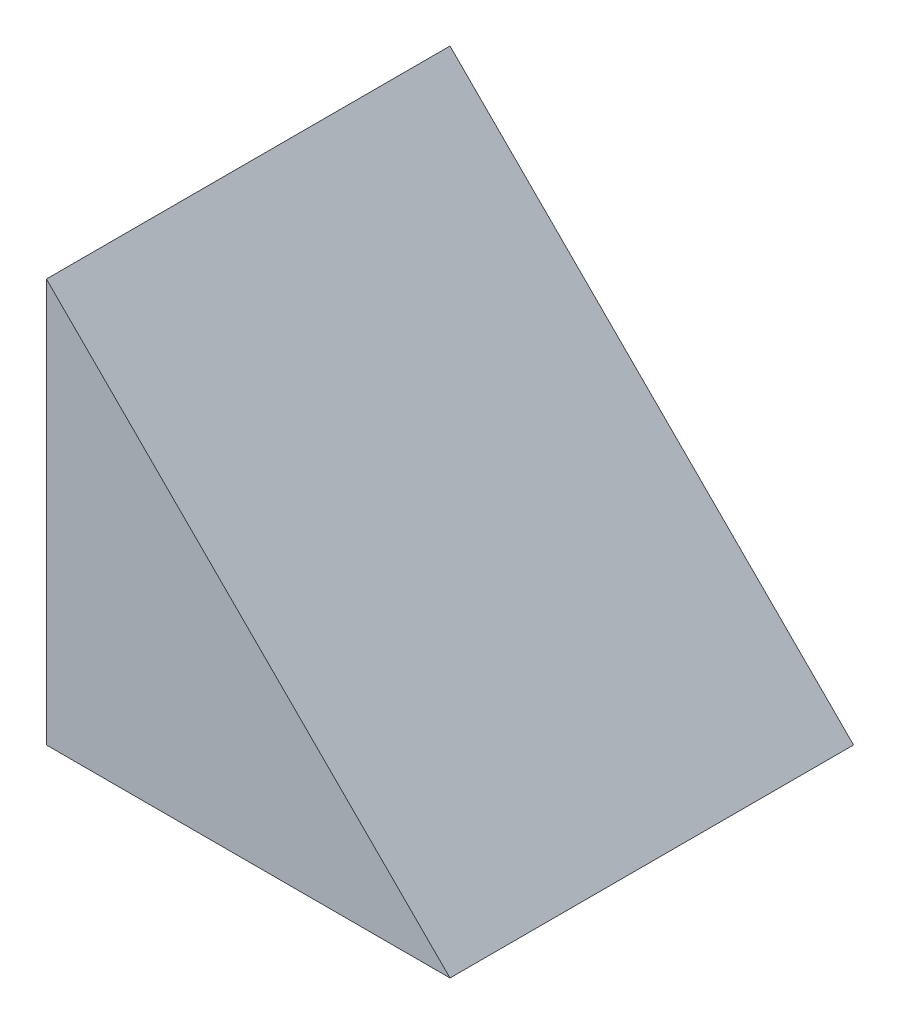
ISO-10303-21;
HEADER;
FILE_DESCRIPTION(('STEP AP214'),'2;1');
FILE_NAME('part.step','',(''),(''),'','','');
FILE_SCHEMA(('AUTOMOTIVE_DESIGN { 1 0 10303 214 1 1 1 1 }'));
ENDSEC;
DATA;
#1=APPLICATION_CONTEXT('core data for automotive mechanical design processes');
#2=APPLICATION_PROTOCOL_DEFINITION('international standard','automotive_design',2000,#1);
#3=PRODUCT_CONTEXT('',#1,'mechanical');
#4=PRODUCT('Part','Part','',(#3));
#5=PRODUCT_RELATED_PRODUCT_CATEGORY('part','',(#4));
#6=PRODUCT_DEFINITION_FORMATION('','',#4);
#7=PRODUCT_DEFINITION_CONTEXT('part definition',#1,'design');
#8=PRODUCT_DEFINITION('design','',#6,#7);
#9=PRODUCT_DEFINITION_SHAPE('','',#8);
#10=(LENGTH_UNIT() NAMED_UNIT(*) SI_UNIT(.MILLI.,.METRE.));
#11=(NAMED_UNIT(*) PLANE_ANGLE_UNIT() SI_UNIT($,.RADIAN.));
#12=(NAMED_UNIT(*) SI_UNIT($,.STERADIAN.) SOLID_ANGLE_UNIT());
#13=UNCERTAINTY_MEASURE_WITH_UNIT(LENGTH_MEASURE(1.E-05),#10,'distance_accuracy_value','');
#14=(GEOMETRIC_REPRESENTATION_CONTEXT(3) GLOBAL_UNCERTAINTY_ASSIGNED_CONTEXT((#13)) GLOBAL_UNIT_ASSIGNED_CONTEXT((#10,
#11,#12)) REPRESENTATION_CONTEXT('',''));
#15=CARTESIAN_POINT('',(0.,0.,0.));
#16=DIRECTION('',(0.,0.,1.));
#17=DIRECTION('',(1.,0.,0.));
#18=AXIS2_PLACEMENT_3D('',#15,#16,#17);
#19=CARTESIAN_POINT('',(0.,0.,15.));
#20=DIRECTION('',(-1.,0.,0.));
#21=DIRECTION('',(0.,-1.,0.));
#22=AXIS2_PLACEMENT_3D('',#19,#20,#21);
#23=PLANE('',#22);
#24=DIRECTION('',(0.,1.,0.));
#25=VECTOR('',#24,1.);
#26=CARTESIAN_POINT('',(0.,0.,0.));
#27=LINE('',#26,#25);
#28=CARTESIAN_POINT('',(0.,0.,0.));
#29=VERTEX_POINT('',#28);
#30=CARTESIAN_POINT('',(0.,15.,0.));
#31=VERTEX_POINT('',#30);
#32=EDGE_CURVE('E69',#29,#31,#27,.T.);
#33=ORIENTED_EDGE('',*,*,#32,.F.);
#34=DIRECTION('',(0.,0.,-1.));
#35=VECTOR('',#34,1.);
#36=CARTESIAN_POINT('',(0.,0.,15.));
#37=LINE('',#36,#35);
#38=CARTESIAN_POINT('',(0.,0.,15.));
#39=VERTEX_POINT('',#38);
#40=EDGE_CURVE('E11',#39,#29,#37,.T.);
#41=ORIENTED_EDGE('',*,*,#40,.F.);
#42=DIRECTION('',(0.,1.,0.));
#43=VECTOR('',#42,1.);
#44=CARTESIAN_POINT('',(0.,0.,15.));
#45=LINE('',#44,#43);
#46=CARTESIAN_POINT('',(0.,15.,15.));
#47=VERTEX_POINT('',#46);
#48=EDGE_CURVE('E67',#39,#47,#45,.T.);
#49=ORIENTED_EDGE('',*,*,#48,.T.);
#50=DIRECTION('',(0.,0.,-1.));
#51=VECTOR('',#50,1.);
#52=CARTESIAN_POINT('',(0.,15.,15.));
#53=LINE('',#52,#51);
#54=EDGE_CURVE('E49',#47,#31,#53,.T.);
#55=ORIENTED_EDGE('',*,*,#54,.T.);
#56=EDGE_LOOP('',(#33,#41,#49,#55));
#57=FACE_BOUND('',#56,.T.);
#58=ADVANCED_FACE('F33',(#57),#23,.T.);
#59=CARTESIAN_POINT('',(0.,0.,15.));
#60=DIRECTION('',(0.,1.,0.));
#61=DIRECTION('',(0.,0.,1.));
#62=AXIS2_PLACEMENT_3D('',#59,#60,#61);
#63=PLANE('',#62);
#64=DIRECTION('',(1.,0.,0.));
#65=VECTOR('',#64,1.);
#66=CARTESIAN_POINT('',(0.,0.,0.));
#67=LINE('',#66,#65);
#68=CARTESIAN_POINT('',(15.,0.,0.));
#69=VERTEX_POINT('',#68);
#70=EDGE_CURVE('E81',#29,#69,#67,.T.);
#71=ORIENTED_EDGE('',*,*,#70,.T.);
#72=DIRECTION('',(0.,0.,-1.));
#73=VECTOR('',#72,1.);
#74=CARTESIAN_POINT('',(15.,0.,15.));
#75=LINE('',#74,#73);
#76=CARTESIAN_POINT('',(15.,0.,15.));
#77=VERTEX_POINT('',#76);
#78=EDGE_CURVE('E41',#77,#69,#75,.T.);
#79=ORIENTED_EDGE('',*,*,#78,.F.);
#80=DIRECTION('',(1.,0.,0.));
#81=VECTOR('',#80,1.);
#82=CARTESIAN_POINT('',(0.,0.,15.));
#83=LINE('',#82,#81);
#84=EDGE_CURVE('E72',#39,#77,#83,.T.);
#85=ORIENTED_EDGE('',*,*,#84,.F.);
#86=ORIENTED_EDGE('',*,*,#40,.T.);
#87=EDGE_LOOP('',(#71,#79,#85,#86));
#88=FACE_BOUND('',#87,.T.);
#89=ADVANCED_FACE('F73',(#88),#63,.F.);
#90=CARTESIAN_POINT('',(7.5,7.5,15.));
#91=DIRECTION('',(0.707106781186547,0.707106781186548,0.));
#92=DIRECTION('',(-0.707106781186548,0.707106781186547,0.));
#93=AXIS2_PLACEMENT_3D('',#90,#91,#92);
#94=PLANE('',#93);
#95=DIRECTION('',(0.707106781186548,-0.707106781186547,0.));
#96=VECTOR('',#95,1.);
#97=CARTESIAN_POINT('',(7.5,7.5,0.));
#98=LINE('',#97,#96);
#99=EDGE_CURVE('E78',#31,#69,#98,.T.);
#100=ORIENTED_EDGE('',*,*,#99,.F.);
#101=ORIENTED_EDGE('',*,*,#54,.F.);
#102=DIRECTION('',(0.707106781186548,-0.707106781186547,0.));
#103=VECTOR('',#102,1.);
#104=CARTESIAN_POINT('',(7.5,7.5,15.));
#105=LINE('',#104,#103);
#106=EDGE_CURVE('E75',#47,#77,#105,.T.);
#107=ORIENTED_EDGE('',*,*,#106,.T.);
#108=ORIENTED_EDGE('',*,*,#78,.T.);
#109=EDGE_LOOP('',(#100,#101,#107,#108));
#110=FACE_BOUND('',#109,.T.);
#111=ADVANCED_FACE('F89',(#110),#94,.T.);
#112=CARTESIAN_POINT('',(0.,0.,15.));
#113=DIRECTION('',(0.,0.,1.));
#114=DIRECTION('',(1.,0.,0.));
#115=AXIS2_PLACEMENT_3D('',#112,#113,#114);
#116=PLANE('',#115);
#117=ORIENTED_EDGE('',*,*,#48,.F.);
#118=ORIENTED_EDGE('',*,*,#84,.T.);
#119=ORIENTED_EDGE('',*,*,#106,.F.);
#120=EDGE_LOOP('',(#117,#118,#119));
#121=FACE_BOUND('',#120,.T.);
#122=ADVANCED_FACE('F77',(#121),#116,.T.);
#123=CARTESIAN_POINT('',(0.,0.,0.));
#124=DIRECTION('',(0.,0.,1.));
#125=DIRECTION('',(1.,0.,0.));
#126=AXIS2_PLACEMENT_3D('',#123,#124,#125);
#127=PLANE('',#126);
#128=ORIENTED_EDGE('',*,*,#32,.T.);
#129=ORIENTED_EDGE('',*,*,#99,.T.);
#130=ORIENTED_EDGE('',*,*,#70,.F.);
#131=EDGE_LOOP('',(#128,#129,#130));
#132=FACE_BOUND('',#131,.T.);
#133=ADVANCED_FACE('F88',(#132),#127,.F.);
#134=CLOSED_SHELL('',(#58,#89,#111,#122,#133));
#135=MANIFOLD_SOLID_BREP('B2',#134);
#136=ADVANCED_BREP_SHAPE_REPRESENTATION('',(#18,#135),#14);
#137=SHAPE_DEFINITION_REPRESENTATION(#9,#136);
ENDSEC;
END-ISO-10303-21;
